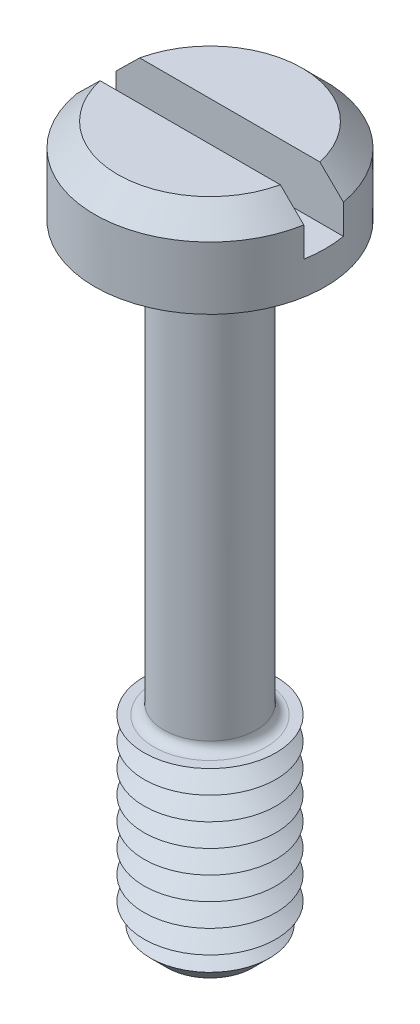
from build123d import *

# Parameters (mm, degrees)
SKETCH1_R           = 3.5
BOSS_EXTRUDE1_DEPTH = 2.6
SKETCH2_R           = 1.4
BOSS_EXTRUDE2_DEPTH = 19
SKETCH3_R           = 2
BOSS_EXTRUDE3_DEPTH = 6
CHAMFER1_SIZE       = 0.7
LPATTERN1_COUNT     = 8
LPATTERN1_PITCH     = 0.7
FILLET1_R           = 0.3
CHAMFER2_SIZE       = 0.7
SKETCH6_W           = 7
SKETCH6_H           = 1.2
CUT_EXTRUDE1_DEPTH  = 1.6


with BuildPart() as part:
    # Sketch1 → Boss-Extrude1 (new body)
    with BuildSketch(Plane(origin=(0, 0, 0), x_dir=(1, 0, 0), z_dir=(0, 1, 0))):
        with Locations(Location((0, 0, 0), (0, 0, 270))):
            Circle(SKETCH1_R)
    extrude(amount=BOSS_EXTRUDE1_DEPTH)

    # Sketch2 → Boss-Extrude2 (add)
    with BuildSketch(Plane.XZ):
        with Locations(Location((0, 0, 0), (0, 0, 270))):
            Circle(SKETCH2_R)
    extrude(amount=BOSS_EXTRUDE2_DEPTH)

    # Sketch3 → Boss-Extrude3 (add)
    with BuildSketch(Plane.XZ.offset(19)):
        with Locations(Location((0, 0, 0), (0, 0, 270))):
            Circle(SKETCH3_R)
    extrude(amount=-BOSS_EXTRUDE3_DEPTH)

    # Chamfer1
    chamfer1_edges = [part.edges().sort_by_distance(p)[0] for p in [
        (0, -19, 2),
    ]]
    chamfer(chamfer1_edges, length=CHAMFER1_SIZE)

    # Sketch5 → Cut-Revolve1 (revolve, cut)
    with BuildSketch(Plane(origin=(0, 0, 0), x_dir=(0, 0, -1), z_dir=(1, 0, 0))):
        Polygon((-2, -13), (-1.393782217, -13.35), (-2, -13.7), align=None)
    cut_revolve1 = revolve(axis=Axis((0, -6.58711856, 0), (0, -1, 0)), mode=Mode.SUBTRACT)

    # LPattern1: Cut-Revolve1 ×8
    with Locations(*[(0, -i * LPATTERN1_PITCH, 0) for i in range(1, LPATTERN1_COUNT)]):
        add(cut_revolve1, mode=Mode.SUBTRACT)

    # Fillet1
    fillet1_edges = [part.edges().sort_by_distance(p)[0] for p in [
        (0, 0, 1.4),
        (0, -13, 1.4),
    ]]
    fillet(fillet1_edges, radius=FILLET1_R)

    # Chamfer2
    chamfer2_edges = [part.edges().sort_by_distance(p)[0] for p in [
        (0, 2.6, -3.5),
    ]]
    chamfer(chamfer2_edges, length=CHAMFER2_SIZE)

    # Sketch6 → Cut-Extrude1 (cut)
    with BuildSketch(Plane(origin=(0, 2.6, 0), x_dir=(1, 0, 0), z_dir=(0, 1, 0))):
        Rectangle(SKETCH6_W, SKETCH6_H)
    extrude(amount=-CUT_EXTRUDE1_DEPTH, mode=Mode.SUBTRACT)


solid = part.part
